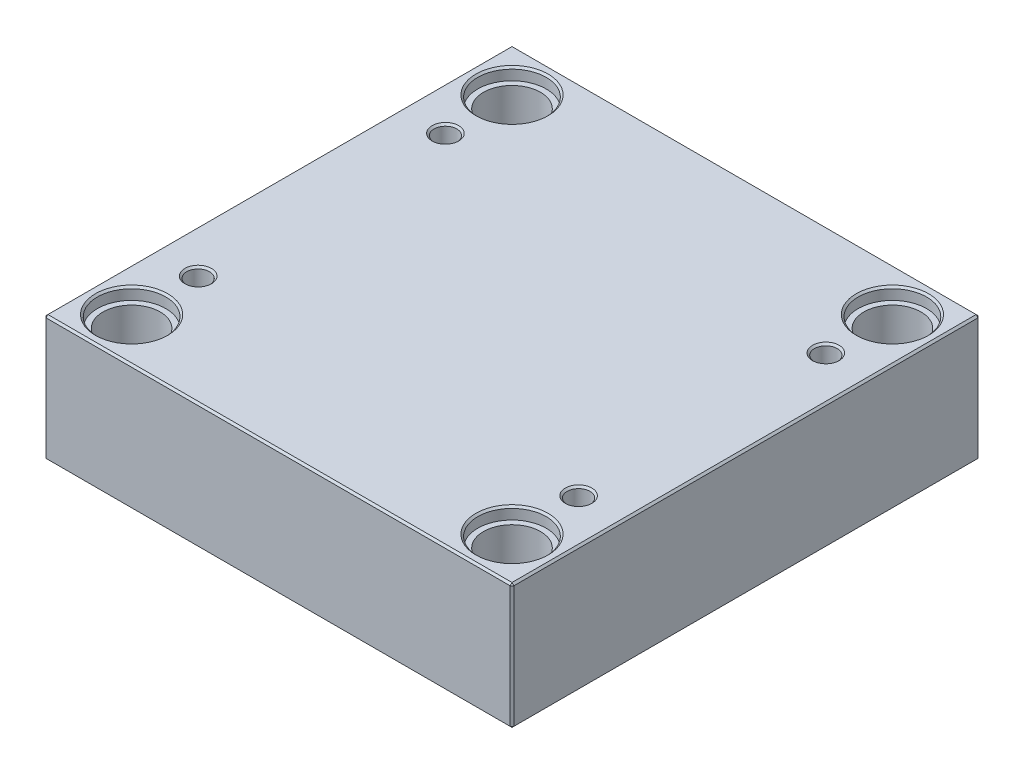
ISO-10303-21;
HEADER;
FILE_DESCRIPTION(('STEP AP214'),'2;1');
FILE_NAME('part.step','',(''),(''),'','','');
FILE_SCHEMA(('AUTOMOTIVE_DESIGN { 1 0 10303 214 1 1 1 1 }'));
ENDSEC;
DATA;
#1=APPLICATION_CONTEXT('core data for automotive mechanical design processes');
#2=APPLICATION_PROTOCOL_DEFINITION('international standard','automotive_design',2000,#1);
#3=PRODUCT_CONTEXT('',#1,'mechanical');
#4=PRODUCT('Part','Part','',(#3));
#5=PRODUCT_RELATED_PRODUCT_CATEGORY('part','',(#4));
#6=PRODUCT_DEFINITION_FORMATION('','',#4);
#7=PRODUCT_DEFINITION_CONTEXT('part definition',#1,'design');
#8=PRODUCT_DEFINITION('design','',#6,#7);
#9=PRODUCT_DEFINITION_SHAPE('','',#8);
#10=(LENGTH_UNIT() NAMED_UNIT(*) SI_UNIT(.MILLI.,.METRE.));
#11=(NAMED_UNIT(*) PLANE_ANGLE_UNIT() SI_UNIT($,.RADIAN.));
#12=(NAMED_UNIT(*) SI_UNIT($,.STERADIAN.) SOLID_ANGLE_UNIT());
#13=UNCERTAINTY_MEASURE_WITH_UNIT(LENGTH_MEASURE(1.E-05),#10,'distance_accuracy_value','');
#14=(GEOMETRIC_REPRESENTATION_CONTEXT(3) GLOBAL_UNCERTAINTY_ASSIGNED_CONTEXT((#13)) GLOBAL_UNIT_ASSIGNED_CONTEXT((#10,
#11,#12)) REPRESENTATION_CONTEXT('',''));
#15=CARTESIAN_POINT('',(0.,0.,0.));
#16=DIRECTION('',(0.,0.,1.));
#17=DIRECTION('',(1.,0.,0.));
#18=AXIS2_PLACEMENT_3D('',#15,#16,#17);
#19=CARTESIAN_POINT('',(-100.,0.,-100.));
#20=DIRECTION('',(0.,1.,0.));
#21=DIRECTION('',(0.,0.,1.));
#22=AXIS2_PLACEMENT_3D('',#19,#20,#21);
#23=CYLINDRICAL_SURFACE('',#22,15.);
#24=CARTESIAN_POINT('',(-100.,1.00000000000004,-100.));
#25=DIRECTION('',(0.,1.,0.));
#26=DIRECTION('',(0.,0.,1.));
#27=AXIS2_PLACEMENT_3D('',#24,#25,#26);
#28=CIRCLE('',#27,15.);
#29=CARTESIAN_POINT('',(-100.,1.00000000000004,-85.));
#30=VERTEX_POINT('',#29);
#31=EDGE_CURVE('E472',#30,#30,#28,.F.);
#32=ORIENTED_EDGE('',*,*,#31,.T.);
#33=EDGE_LOOP('',(#32));
#34=FACE_BOUND('',#33,.T.);
#35=CARTESIAN_POINT('',(-100.,59.7,-100.));
#36=DIRECTION('',(0.,1.,0.));
#37=DIRECTION('',(0.,0.,1.));
#38=AXIS2_PLACEMENT_3D('',#35,#36,#37);
#39=CIRCLE('',#38,15.);
#40=CARTESIAN_POINT('',(-100.,59.7,-85.));
#41=VERTEX_POINT('',#40);
#42=EDGE_CURVE('E221',#41,#41,#39,.F.);
#43=ORIENTED_EDGE('',*,*,#42,.F.);
#44=EDGE_LOOP('',(#43));
#45=FACE_BOUND('',#44,.T.);
#46=ADVANCED_FACE('F16',(#34,#45),#23,.F.);
#47=CARTESIAN_POINT('',(100.,0.,-100.));
#48=DIRECTION('',(0.,1.,0.));
#49=DIRECTION('',(0.,0.,1.));
#50=AXIS2_PLACEMENT_3D('',#47,#48,#49);
#51=CYLINDRICAL_SURFACE('',#50,15.);
#52=CARTESIAN_POINT('',(100.,1.00000000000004,-100.));
#53=DIRECTION('',(0.,1.,0.));
#54=DIRECTION('',(0.,0.,1.));
#55=AXIS2_PLACEMENT_3D('',#52,#53,#54);
#56=CIRCLE('',#55,15.);
#57=CARTESIAN_POINT('',(100.,1.00000000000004,-85.));
#58=VERTEX_POINT('',#57);
#59=EDGE_CURVE('E474',#58,#58,#56,.F.);
#60=ORIENTED_EDGE('',*,*,#59,.T.);
#61=EDGE_LOOP('',(#60));
#62=FACE_BOUND('',#61,.T.);
#63=CARTESIAN_POINT('',(100.,59.7,-100.));
#64=DIRECTION('',(0.,1.,0.));
#65=DIRECTION('',(0.,0.,1.));
#66=AXIS2_PLACEMENT_3D('',#63,#64,#65);
#67=CIRCLE('',#66,15.);
#68=CARTESIAN_POINT('',(100.,59.7,-85.));
#69=VERTEX_POINT('',#68);
#70=EDGE_CURVE('E218',#69,#69,#67,.F.);
#71=ORIENTED_EDGE('',*,*,#70,.F.);
#72=EDGE_LOOP('',(#71));
#73=FACE_BOUND('',#72,.T.);
#74=ADVANCED_FACE('F263',(#62,#73),#51,.F.);
#75=CARTESIAN_POINT('',(100.,0.,100.));
#76=DIRECTION('',(0.,1.,0.));
#77=DIRECTION('',(0.,0.,1.));
#78=AXIS2_PLACEMENT_3D('',#75,#76,#77);
#79=CYLINDRICAL_SURFACE('',#78,15.);
#80=CARTESIAN_POINT('',(100.,1.00000000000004,100.));
#81=DIRECTION('',(0.,1.,0.));
#82=DIRECTION('',(0.,0.,1.));
#83=AXIS2_PLACEMENT_3D('',#80,#81,#82);
#84=CIRCLE('',#83,15.);
#85=CARTESIAN_POINT('',(100.,1.00000000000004,115.));
#86=VERTEX_POINT('',#85);
#87=EDGE_CURVE('E477',#86,#86,#84,.F.);
#88=ORIENTED_EDGE('',*,*,#87,.T.);
#89=EDGE_LOOP('',(#88));
#90=FACE_BOUND('',#89,.T.);
#91=CARTESIAN_POINT('',(100.,59.7,100.));
#92=DIRECTION('',(0.,1.,0.));
#93=DIRECTION('',(0.,0.,1.));
#94=AXIS2_PLACEMENT_3D('',#91,#92,#93);
#95=CIRCLE('',#94,15.);
#96=CARTESIAN_POINT('',(100.,59.7,115.));
#97=VERTEX_POINT('',#96);
#98=EDGE_CURVE('E214',#97,#97,#95,.F.);
#99=ORIENTED_EDGE('',*,*,#98,.F.);
#100=EDGE_LOOP('',(#99));
#101=FACE_BOUND('',#100,.T.);
#102=ADVANCED_FACE('F270',(#90,#101),#79,.F.);
#103=CARTESIAN_POINT('',(-100.,0.,100.));
#104=DIRECTION('',(0.,1.,0.));
#105=DIRECTION('',(0.,0.,1.));
#106=AXIS2_PLACEMENT_3D('',#103,#104,#105);
#107=CYLINDRICAL_SURFACE('',#106,15.);
#108=CARTESIAN_POINT('',(-100.,0.999999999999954,100.));
#109=DIRECTION('',(0.,1.,0.));
#110=DIRECTION('',(0.,0.,1.));
#111=AXIS2_PLACEMENT_3D('',#108,#109,#110);
#112=CIRCLE('',#111,15.);
#113=CARTESIAN_POINT('',(-100.,0.999999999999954,115.));
#114=VERTEX_POINT('',#113);
#115=EDGE_CURVE('E480',#114,#114,#112,.F.);
#116=ORIENTED_EDGE('',*,*,#115,.T.);
#117=EDGE_LOOP('',(#116));
#118=FACE_BOUND('',#117,.T.);
#119=CARTESIAN_POINT('',(-100.,59.7,100.));
#120=DIRECTION('',(0.,1.,0.));
#121=DIRECTION('',(0.,0.,1.));
#122=AXIS2_PLACEMENT_3D('',#119,#120,#121);
#123=CIRCLE('',#122,15.);
#124=CARTESIAN_POINT('',(-100.,59.7,115.));
#125=VERTEX_POINT('',#124);
#126=EDGE_CURVE('E211',#125,#125,#123,.F.);
#127=ORIENTED_EDGE('',*,*,#126,.F.);
#128=EDGE_LOOP('',(#127));
#129=FACE_BOUND('',#128,.T.);
#130=ADVANCED_FACE('F277',(#118,#129),#107,.F.);
#131=CARTESIAN_POINT('',(-123.,66.,123.));
#132=DIRECTION('',(1.,0.,0.));
#133=DIRECTION('',(0.,0.,-1.));
#134=AXIS2_PLACEMENT_3D('',#131,#132,#133);
#135=PLANE('',#134);
#136=DIRECTION('',(0.,-1.,0.));
#137=VECTOR('',#136,1.);
#138=CARTESIAN_POINT('',(-123.,66.,-122.));
#139=LINE('',#138,#137);
#140=CARTESIAN_POINT('',(-123.,65.,-122.));
#141=VERTEX_POINT('',#140);
#142=CARTESIAN_POINT('',(-123.,1.,-122.));
#143=VERTEX_POINT('',#142);
#144=EDGE_CURVE('E487',#141,#143,#139,.T.);
#145=ORIENTED_EDGE('',*,*,#144,.T.);
#146=DIRECTION('',(0.,0.,1.));
#147=VECTOR('',#146,1.);
#148=CARTESIAN_POINT('',(-123.,1.,123.));
#149=LINE('',#148,#147);
#150=CARTESIAN_POINT('',(-123.,1.,122.));
#151=VERTEX_POINT('',#150);
#152=EDGE_CURVE('E490',#143,#151,#149,.T.);
#153=ORIENTED_EDGE('',*,*,#152,.T.);
#154=DIRECTION('',(0.,1.,0.));
#155=VECTOR('',#154,1.);
#156=CARTESIAN_POINT('',(-123.,66.,122.));
#157=LINE('',#156,#155);
#158=CARTESIAN_POINT('',(-123.,65.,122.));
#159=VERTEX_POINT('',#158);
#160=EDGE_CURVE('E485',#151,#159,#157,.T.);
#161=ORIENTED_EDGE('',*,*,#160,.T.);
#162=DIRECTION('',(0.,0.,-1.));
#163=VECTOR('',#162,1.);
#164=CARTESIAN_POINT('',(-123.,65.,-123.));
#165=LINE('',#164,#163);
#166=EDGE_CURVE('E483',#159,#141,#165,.T.);
#167=ORIENTED_EDGE('',*,*,#166,.T.);
#168=EDGE_LOOP('',(#145,#153,#161,#167));
#169=FACE_BOUND('',#168,.T.);
#170=ADVANCED_FACE('F298',(#169),#135,.F.);
#171=CARTESIAN_POINT('',(123.,66.,123.));
#172=DIRECTION('',(0.,0.,-1.));
#173=DIRECTION('',(-1.,0.,0.));
#174=AXIS2_PLACEMENT_3D('',#171,#172,#173);
#175=PLANE('',#174);
#176=DIRECTION('',(-1.,0.,0.));
#177=VECTOR('',#176,1.);
#178=CARTESIAN_POINT('',(-123.,65.,123.));
#179=LINE('',#178,#177);
#180=CARTESIAN_POINT('',(122.,65.,123.));
#181=VERTEX_POINT('',#180);
#182=CARTESIAN_POINT('',(-122.,65.,123.));
#183=VERTEX_POINT('',#182);
#184=EDGE_CURVE('E509',#181,#183,#179,.T.);
#185=ORIENTED_EDGE('',*,*,#184,.T.);
#186=DIRECTION('',(0.,-1.,0.));
#187=VECTOR('',#186,1.);
#188=CARTESIAN_POINT('',(-122.,66.,123.));
#189=LINE('',#188,#187);
#190=CARTESIAN_POINT('',(-122.,1.,123.));
#191=VERTEX_POINT('',#190);
#192=EDGE_CURVE('E515',#183,#191,#189,.T.);
#193=ORIENTED_EDGE('',*,*,#192,.T.);
#194=DIRECTION('',(1.,0.,0.));
#195=VECTOR('',#194,1.);
#196=CARTESIAN_POINT('',(123.,1.,123.));
#197=LINE('',#196,#195);
#198=CARTESIAN_POINT('',(122.,1.,123.));
#199=VERTEX_POINT('',#198);
#200=EDGE_CURVE('E513',#191,#199,#197,.T.);
#201=ORIENTED_EDGE('',*,*,#200,.T.);
#202=DIRECTION('',(0.,1.,0.));
#203=VECTOR('',#202,1.);
#204=CARTESIAN_POINT('',(122.,66.,123.));
#205=LINE('',#204,#203);
#206=EDGE_CURVE('E511',#199,#181,#205,.T.);
#207=ORIENTED_EDGE('',*,*,#206,.T.);
#208=EDGE_LOOP('',(#185,#193,#201,#207));
#209=FACE_BOUND('',#208,.T.);
#210=ADVANCED_FACE('F294',(#209),#175,.F.);
#211=CARTESIAN_POINT('',(123.,66.,123.));
#212=DIRECTION('',(-1.,0.,0.));
#213=DIRECTION('',(0.,0.,1.));
#214=AXIS2_PLACEMENT_3D('',#211,#212,#213);
#215=PLANE('',#214);
#216=DIRECTION('',(0.,0.,-1.));
#217=VECTOR('',#216,1.);
#218=CARTESIAN_POINT('',(123.,1.,123.));
#219=LINE('',#218,#217);
#220=CARTESIAN_POINT('',(123.,1.,122.));
#221=VERTEX_POINT('',#220);
#222=CARTESIAN_POINT('',(123.,1.,-122.));
#223=VERTEX_POINT('',#222);
#224=EDGE_CURVE('E504',#221,#223,#219,.T.);
#225=ORIENTED_EDGE('',*,*,#224,.T.);
#226=DIRECTION('',(0.,1.,0.));
#227=VECTOR('',#226,1.);
#228=CARTESIAN_POINT('',(123.,66.,-122.));
#229=LINE('',#228,#227);
#230=CARTESIAN_POINT('',(123.,65.,-122.));
#231=VERTEX_POINT('',#230);
#232=EDGE_CURVE('E506',#223,#231,#229,.T.);
#233=ORIENTED_EDGE('',*,*,#232,.T.);
#234=DIRECTION('',(0.,0.,1.));
#235=VECTOR('',#234,1.);
#236=CARTESIAN_POINT('',(123.,65.,123.));
#237=LINE('',#236,#235);
#238=CARTESIAN_POINT('',(123.,65.,122.));
#239=VERTEX_POINT('',#238);
#240=EDGE_CURVE('E500',#231,#239,#237,.T.);
#241=ORIENTED_EDGE('',*,*,#240,.T.);
#242=DIRECTION('',(0.,-1.,0.));
#243=VECTOR('',#242,1.);
#244=CARTESIAN_POINT('',(123.,66.,122.));
#245=LINE('',#244,#243);
#246=EDGE_CURVE('E502',#239,#221,#245,.T.);
#247=ORIENTED_EDGE('',*,*,#246,.T.);
#248=EDGE_LOOP('',(#225,#233,#241,#247));
#249=FACE_BOUND('',#248,.T.);
#250=ADVANCED_FACE('F290',(#249),#215,.F.);
#251=CARTESIAN_POINT('',(123.,66.,-123.));
#252=DIRECTION('',(0.,0.,1.));
#253=DIRECTION('',(1.,0.,0.));
#254=AXIS2_PLACEMENT_3D('',#251,#252,#253);
#255=PLANE('',#254);
#256=DIRECTION('',(0.,-1.,0.));
#257=VECTOR('',#256,1.);
#258=CARTESIAN_POINT('',(122.,66.,-123.));
#259=LINE('',#258,#257);
#260=CARTESIAN_POINT('',(122.,65.,-123.));
#261=VERTEX_POINT('',#260);
#262=CARTESIAN_POINT('',(122.,1.,-123.));
#263=VERTEX_POINT('',#262);
#264=EDGE_CURVE('E494',#261,#263,#259,.T.);
#265=ORIENTED_EDGE('',*,*,#264,.T.);
#266=DIRECTION('',(-1.,0.,0.));
#267=VECTOR('',#266,1.);
#268=CARTESIAN_POINT('',(123.,1.,-123.));
#269=LINE('',#268,#267);
#270=CARTESIAN_POINT('',(-122.,1.,-123.));
#271=VERTEX_POINT('',#270);
#272=EDGE_CURVE('E138',#263,#271,#269,.T.);
#273=ORIENTED_EDGE('',*,*,#272,.T.);
#274=DIRECTION('',(0.,1.,0.));
#275=VECTOR('',#274,1.);
#276=CARTESIAN_POINT('',(-122.,66.,-123.));
#277=LINE('',#276,#275);
#278=CARTESIAN_POINT('',(-122.,65.,-123.));
#279=VERTEX_POINT('',#278);
#280=EDGE_CURVE('E496',#271,#279,#277,.T.);
#281=ORIENTED_EDGE('',*,*,#280,.T.);
#282=DIRECTION('',(1.,0.,0.));
#283=VECTOR('',#282,1.);
#284=CARTESIAN_POINT('',(123.,65.,-123.));
#285=LINE('',#284,#283);
#286=EDGE_CURVE('E492',#279,#261,#285,.T.);
#287=ORIENTED_EDGE('',*,*,#286,.T.);
#288=EDGE_LOOP('',(#265,#273,#281,#287));
#289=FACE_BOUND('',#288,.T.);
#290=ADVANCED_FACE('F282',(#289),#255,.F.);
#291=CARTESIAN_POINT('',(0.,66.,0.));
#292=DIRECTION('',(0.,1.,0.));
#293=DIRECTION('',(0.,0.,1.));
#294=AXIS2_PLACEMENT_3D('',#291,#292,#293);
#295=PLANE('',#294);
#296=CARTESIAN_POINT('',(100.,66.,100.));
#297=DIRECTION('',(0.,1.,0.));
#298=DIRECTION('',(0.,0.,1.));
#299=AXIS2_PLACEMENT_3D('',#296,#297,#298);
#300=CIRCLE('',#299,19.);
#301=CARTESIAN_POINT('',(100.,66.,119.));
#302=VERTEX_POINT('',#301);
#303=EDGE_CURVE('E236',#302,#302,#300,.F.);
#304=ORIENTED_EDGE('',*,*,#303,.T.);
#305=EDGE_LOOP('',(#304));
#306=FACE_BOUND('',#305,.T.);
#307=CARTESIAN_POINT('',(-100.,66.,100.));
#308=DIRECTION('',(0.,1.,0.));
#309=DIRECTION('',(0.,0.,1.));
#310=AXIS2_PLACEMENT_3D('',#307,#308,#309);
#311=CIRCLE('',#310,19.);
#312=CARTESIAN_POINT('',(-100.,66.,119.));
#313=VERTEX_POINT('',#312);
#314=EDGE_CURVE('E233',#313,#313,#311,.F.);
#315=ORIENTED_EDGE('',*,*,#314,.T.);
#316=EDGE_LOOP('',(#315));
#317=FACE_BOUND('',#316,.T.);
#318=CARTESIAN_POINT('',(100.,66.,-100.));
#319=DIRECTION('',(0.,1.,0.));
#320=DIRECTION('',(0.,0.,1.));
#321=AXIS2_PLACEMENT_3D('',#318,#319,#320);
#322=CIRCLE('',#321,19.);
#323=CARTESIAN_POINT('',(100.,66.,-81.));
#324=VERTEX_POINT('',#323);
#325=EDGE_CURVE('E230',#324,#324,#322,.F.);
#326=ORIENTED_EDGE('',*,*,#325,.T.);
#327=EDGE_LOOP('',(#326));
#328=FACE_BOUND('',#327,.T.);
#329=CARTESIAN_POINT('',(-100.,66.,-100.));
#330=DIRECTION('',(0.,1.,0.));
#331=DIRECTION('',(0.,0.,1.));
#332=AXIS2_PLACEMENT_3D('',#329,#330,#331);
#333=CIRCLE('',#332,19.);
#334=CARTESIAN_POINT('',(-100.,66.,-81.));
#335=VERTEX_POINT('',#334);
#336=EDGE_CURVE('E227',#335,#335,#333,.F.);
#337=ORIENTED_EDGE('',*,*,#336,.T.);
#338=EDGE_LOOP('',(#337));
#339=FACE_BOUND('',#338,.T.);
#340=CARTESIAN_POINT('',(-100.,66.,65.));
#341=DIRECTION('',(0.,1.,0.));
#342=DIRECTION('',(0.,0.,1.));
#343=AXIS2_PLACEMENT_3D('',#340,#341,#342);
#344=CIRCLE('',#343,7.);
#345=CARTESIAN_POINT('',(-100.,66.,72.));
#346=VERTEX_POINT('',#345);
#347=EDGE_CURVE('E198',#346,#346,#344,.F.);
#348=ORIENTED_EDGE('',*,*,#347,.T.);
#349=EDGE_LOOP('',(#348));
#350=FACE_BOUND('',#349,.T.);
#351=CARTESIAN_POINT('',(100.,66.,65.));
#352=DIRECTION('',(0.,1.,0.));
#353=DIRECTION('',(0.,0.,1.));
#354=AXIS2_PLACEMENT_3D('',#351,#352,#353);
#355=CIRCLE('',#354,7.);
#356=CARTESIAN_POINT('',(100.,66.,72.));
#357=VERTEX_POINT('',#356);
#358=EDGE_CURVE('E195',#357,#357,#355,.F.);
#359=ORIENTED_EDGE('',*,*,#358,.T.);
#360=EDGE_LOOP('',(#359));
#361=FACE_BOUND('',#360,.T.);
#362=CARTESIAN_POINT('',(100.,66.,-65.));
#363=DIRECTION('',(0.,1.,0.));
#364=DIRECTION('',(0.,0.,1.));
#365=AXIS2_PLACEMENT_3D('',#362,#363,#364);
#366=CIRCLE('',#365,7.);
#367=CARTESIAN_POINT('',(100.,66.,-58.));
#368=VERTEX_POINT('',#367);
#369=EDGE_CURVE('E192',#368,#368,#366,.F.);
#370=ORIENTED_EDGE('',*,*,#369,.T.);
#371=EDGE_LOOP('',(#370));
#372=FACE_BOUND('',#371,.T.);
#373=CARTESIAN_POINT('',(-100.,66.,-65.));
#374=DIRECTION('',(0.,1.,0.));
#375=DIRECTION('',(0.,0.,1.));
#376=AXIS2_PLACEMENT_3D('',#373,#374,#375);
#377=CIRCLE('',#376,7.);
#378=CARTESIAN_POINT('',(-100.,66.,-58.));
#379=VERTEX_POINT('',#378);
#380=EDGE_CURVE('E188',#379,#379,#377,.F.);
#381=ORIENTED_EDGE('',*,*,#380,.T.);
#382=EDGE_LOOP('',(#381));
#383=FACE_BOUND('',#382,.T.);
#384=DIRECTION('',(0.,0.,-1.));
#385=VECTOR('',#384,1.);
#386=CARTESIAN_POINT('',(122.,66.,-123.));
#387=LINE('',#386,#385);
#388=CARTESIAN_POINT('',(122.,66.,122.));
#389=VERTEX_POINT('',#388);
#390=CARTESIAN_POINT('',(122.,66.,-122.));
#391=VERTEX_POINT('',#390);
#392=EDGE_CURVE('E31',#389,#391,#387,.T.);
#393=ORIENTED_EDGE('',*,*,#392,.T.);
#394=DIRECTION('',(-1.,0.,0.));
#395=VECTOR('',#394,1.);
#396=CARTESIAN_POINT('',(-123.,66.,-122.));
#397=LINE('',#396,#395);
#398=CARTESIAN_POINT('',(-122.,66.,-122.));
#399=VERTEX_POINT('',#398);
#400=EDGE_CURVE('E189',#391,#399,#397,.T.);
#401=ORIENTED_EDGE('',*,*,#400,.T.);
#402=DIRECTION('',(0.,0.,1.));
#403=VECTOR('',#402,1.);
#404=CARTESIAN_POINT('',(-122.,66.,123.));
#405=LINE('',#404,#403);
#406=CARTESIAN_POINT('',(-122.,66.,122.));
#407=VERTEX_POINT('',#406);
#408=EDGE_CURVE('E518',#399,#407,#405,.T.);
#409=ORIENTED_EDGE('',*,*,#408,.T.);
#410=DIRECTION('',(1.,0.,0.));
#411=VECTOR('',#410,1.);
#412=CARTESIAN_POINT('',(123.,66.,122.));
#413=LINE('',#412,#411);
#414=EDGE_CURVE('E36',#407,#389,#413,.T.);
#415=ORIENTED_EDGE('',*,*,#414,.T.);
#416=EDGE_LOOP('',(#393,#401,#409,#415));
#417=FACE_BOUND('',#416,.T.);
#418=ADVANCED_FACE('F279',(#306,#317,#328,#339,#350,#361,#372,#383,#417),#295,.T.);
#419=CARTESIAN_POINT('',(0.,0.,0.));
#420=DIRECTION('',(0.,1.,0.));
#421=DIRECTION('',(0.,0.,1.));
#422=AXIS2_PLACEMENT_3D('',#419,#420,#421);
#423=PLANE('',#422);
#424=CARTESIAN_POINT('',(-100.,0.,-100.));
#425=DIRECTION('',(0.,1.,0.));
#426=DIRECTION('',(0.,0.,1.));
#427=AXIS2_PLACEMENT_3D('',#424,#425,#426);
#428=CIRCLE('',#427,16.);
#429=CARTESIAN_POINT('',(-100.,0.,-84.));
#430=VERTEX_POINT('',#429);
#431=EDGE_CURVE('E469',#430,#430,#428,.T.);
#432=ORIENTED_EDGE('',*,*,#431,.T.);
#433=EDGE_LOOP('',(#432));
#434=FACE_BOUND('',#433,.T.);
#435=CARTESIAN_POINT('',(100.,0.,-100.));
#436=DIRECTION('',(0.,1.,0.));
#437=DIRECTION('',(0.,0.,1.));
#438=AXIS2_PLACEMENT_3D('',#435,#436,#437);
#439=CIRCLE('',#438,16.);
#440=CARTESIAN_POINT('',(100.,0.,-84.));
#441=VERTEX_POINT('',#440);
#442=EDGE_CURVE('E466',#441,#441,#439,.T.);
#443=ORIENTED_EDGE('',*,*,#442,.T.);
#444=EDGE_LOOP('',(#443));
#445=FACE_BOUND('',#444,.T.);
#446=CARTESIAN_POINT('',(100.,0.,100.));
#447=DIRECTION('',(0.,1.,0.));
#448=DIRECTION('',(0.,0.,1.));
#449=AXIS2_PLACEMENT_3D('',#446,#447,#448);
#450=CIRCLE('',#449,16.);
#451=CARTESIAN_POINT('',(100.,0.,116.));
#452=VERTEX_POINT('',#451);
#453=EDGE_CURVE('E463',#452,#452,#450,.T.);
#454=ORIENTED_EDGE('',*,*,#453,.T.);
#455=EDGE_LOOP('',(#454));
#456=FACE_BOUND('',#455,.T.);
#457=CARTESIAN_POINT('',(-100.,0.,100.));
#458=DIRECTION('',(0.,1.,0.));
#459=DIRECTION('',(0.,0.,1.));
#460=AXIS2_PLACEMENT_3D('',#457,#458,#459);
#461=CIRCLE('',#460,16.);
#462=CARTESIAN_POINT('',(-100.,0.,116.));
#463=VERTEX_POINT('',#462);
#464=EDGE_CURVE('E460',#463,#463,#461,.T.);
#465=ORIENTED_EDGE('',*,*,#464,.T.);
#466=EDGE_LOOP('',(#465));
#467=FACE_BOUND('',#466,.T.);
#468=DIRECTION('',(0.,0.,1.));
#469=VECTOR('',#468,1.);
#470=CARTESIAN_POINT('',(122.,0.,0.));
#471=LINE('',#470,#469);
#472=CARTESIAN_POINT('',(122.,0.,-122.));
#473=VERTEX_POINT('',#472);
#474=CARTESIAN_POINT('',(122.,0.,122.));
#475=VERTEX_POINT('',#474);
#476=EDGE_CURVE('E108',#473,#475,#471,.T.);
#477=ORIENTED_EDGE('',*,*,#476,.T.);
#478=DIRECTION('',(-1.,0.,0.));
#479=VECTOR('',#478,1.);
#480=CARTESIAN_POINT('',(0.,0.,122.));
#481=LINE('',#480,#479);
#482=CARTESIAN_POINT('',(-122.,0.,122.));
#483=VERTEX_POINT('',#482);
#484=EDGE_CURVE('E458',#475,#483,#481,.T.);
#485=ORIENTED_EDGE('',*,*,#484,.T.);
#486=DIRECTION('',(0.,0.,-1.));
#487=VECTOR('',#486,1.);
#488=CARTESIAN_POINT('',(-122.,0.,0.));
#489=LINE('',#488,#487);
#490=CARTESIAN_POINT('',(-122.,0.,-122.));
#491=VERTEX_POINT('',#490);
#492=EDGE_CURVE('E110',#483,#491,#489,.T.);
#493=ORIENTED_EDGE('',*,*,#492,.T.);
#494=DIRECTION('',(1.,0.,0.));
#495=VECTOR('',#494,1.);
#496=CARTESIAN_POINT('',(0.,0.,-122.));
#497=LINE('',#496,#495);
#498=EDGE_CURVE('E104',#491,#473,#497,.T.);
#499=ORIENTED_EDGE('',*,*,#498,.T.);
#500=EDGE_LOOP('',(#477,#485,#493,#499));
#501=FACE_BOUND('',#500,.T.);
#502=ADVANCED_FACE('F106',(#434,#445,#456,#467,#501),#423,.F.);
#503=CARTESIAN_POINT('',(-100.,0.,-100.));
#504=DIRECTION('',(0.,-1.,0.));
#505=DIRECTION('',(0.,0.,-1.));
#506=AXIS2_PLACEMENT_3D('',#503,#504,#505);
#507=CONICAL_SURFACE('',#506,16.,0.785398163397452);
#508=ORIENTED_EDGE('',*,*,#31,.F.);
#509=EDGE_LOOP('',(#508));
#510=FACE_BOUND('',#509,.T.);
#511=ORIENTED_EDGE('',*,*,#431,.F.);
#512=EDGE_LOOP('',(#511));
#513=FACE_BOUND('',#512,.T.);
#514=ADVANCED_FACE('F286',(#510,#513),#507,.F.);
#515=CARTESIAN_POINT('',(100.,0.,-100.));
#516=DIRECTION('',(0.,-1.,0.));
#517=DIRECTION('',(0.,0.,-1.));
#518=AXIS2_PLACEMENT_3D('',#515,#516,#517);
#519=CONICAL_SURFACE('',#518,16.,0.785398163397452);
#520=ORIENTED_EDGE('',*,*,#59,.F.);
#521=EDGE_LOOP('',(#520));
#522=FACE_BOUND('',#521,.T.);
#523=ORIENTED_EDGE('',*,*,#442,.F.);
#524=EDGE_LOOP('',(#523));
#525=FACE_BOUND('',#524,.T.);
#526=ADVANCED_FACE('F305',(#522,#525),#519,.F.);
#527=CARTESIAN_POINT('',(100.,0.,100.));
#528=DIRECTION('',(0.,-1.,0.));
#529=DIRECTION('',(0.,0.,-1.));
#530=AXIS2_PLACEMENT_3D('',#527,#528,#529);
#531=CONICAL_SURFACE('',#530,16.,0.785398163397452);
#532=ORIENTED_EDGE('',*,*,#87,.F.);
#533=EDGE_LOOP('',(#532));
#534=FACE_BOUND('',#533,.T.);
#535=ORIENTED_EDGE('',*,*,#453,.F.);
#536=EDGE_LOOP('',(#535));
#537=FACE_BOUND('',#536,.T.);
#538=ADVANCED_FACE('F309',(#534,#537),#531,.F.);
#539=CARTESIAN_POINT('',(-100.,0.,100.));
#540=DIRECTION('',(0.,-1.,0.));
#541=DIRECTION('',(0.,0.,-1.));
#542=AXIS2_PLACEMENT_3D('',#539,#540,#541);
#543=CONICAL_SURFACE('',#542,16.,0.785398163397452);
#544=ORIENTED_EDGE('',*,*,#115,.F.);
#545=EDGE_LOOP('',(#544));
#546=FACE_BOUND('',#545,.T.);
#547=ORIENTED_EDGE('',*,*,#464,.F.);
#548=EDGE_LOOP('',(#547));
#549=FACE_BOUND('',#548,.T.);
#550=ADVANCED_FACE('F313',(#546,#549),#543,.F.);
#551=CARTESIAN_POINT('',(123.,66.,122.));
#552=DIRECTION('',(-0.707106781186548,0.,-0.707106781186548));
#553=DIRECTION('',(0.,-1.,0.));
#554=AXIS2_PLACEMENT_3D('',#551,#552,#553);
#555=PLANE('',#554);
#556=DIRECTION('',(-0.707106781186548,0.,0.707106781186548));
#557=VECTOR('',#556,1.);
#558=CARTESIAN_POINT('',(122.,65.,123.));
#559=LINE('',#558,#557);
#560=EDGE_CURVE('E126',#181,#239,#559,.F.);
#561=ORIENTED_EDGE('',*,*,#560,.F.);
#562=ORIENTED_EDGE('',*,*,#206,.F.);
#563=DIRECTION('',(0.707106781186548,0.,-0.707106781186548));
#564=VECTOR('',#563,1.);
#565=CARTESIAN_POINT('',(122.,1.,123.));
#566=LINE('',#565,#564);
#567=EDGE_CURVE('E180',#221,#199,#566,.F.);
#568=ORIENTED_EDGE('',*,*,#567,.F.);
#569=ORIENTED_EDGE('',*,*,#246,.F.);
#570=EDGE_LOOP('',(#561,#562,#568,#569));
#571=FACE_BOUND('',#570,.T.);
#572=ADVANCED_FACE('F317',(#571),#555,.F.);
#573=CARTESIAN_POINT('',(122.,65.,123.));
#574=DIRECTION('',(0.577350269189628,0.57735026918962,0.577350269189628));
#575=DIRECTION('',(0.707106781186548,0.,-0.707106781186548));
#576=AXIS2_PLACEMENT_3D('',#573,#574,#575);
#577=PLANE('',#576);
#578=DIRECTION('',(0.,-0.70710678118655,0.707106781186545));
#579=VECTOR('',#578,1.);
#580=CARTESIAN_POINT('',(122.,65.,123.));
#581=LINE('',#580,#579);
#582=EDGE_CURVE('E175',#181,#389,#581,.F.);
#583=ORIENTED_EDGE('',*,*,#582,.F.);
#584=ORIENTED_EDGE('',*,*,#560,.T.);
#585=DIRECTION('',(-0.707106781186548,0.707106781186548,0.));
#586=VECTOR('',#585,1.);
#587=CARTESIAN_POINT('',(122.5,65.5,122.));
#588=LINE('',#587,#586);
#589=EDGE_CURVE('E177',#389,#239,#588,.F.);
#590=ORIENTED_EDGE('',*,*,#589,.F.);
#591=EDGE_LOOP('',(#583,#584,#590));
#592=FACE_BOUND('',#591,.T.);
#593=ADVANCED_FACE('F385',(#592),#577,.T.);
#594=CARTESIAN_POINT('',(122.,1.,123.));
#595=DIRECTION('',(0.577350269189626,-0.577350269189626,0.577350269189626));
#596=DIRECTION('',(0.707106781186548,0.,-0.707106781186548));
#597=AXIS2_PLACEMENT_3D('',#594,#595,#596);
#598=PLANE('',#597);
#599=DIRECTION('',(-0.707106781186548,-0.707106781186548,0.));
#600=VECTOR('',#599,1.);
#601=CARTESIAN_POINT('',(122.5,0.5,122.));
#602=LINE('',#601,#600);
#603=EDGE_CURVE('E124',#221,#475,#602,.T.);
#604=ORIENTED_EDGE('',*,*,#603,.F.);
#605=ORIENTED_EDGE('',*,*,#567,.T.);
#606=DIRECTION('',(0.,0.70710678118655,0.707106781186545));
#607=VECTOR('',#606,1.);
#608=CARTESIAN_POINT('',(122.,1.,123.));
#609=LINE('',#608,#607);
#610=EDGE_CURVE('E172',#475,#199,#609,.T.);
#611=ORIENTED_EDGE('',*,*,#610,.F.);
#612=EDGE_LOOP('',(#604,#605,#611));
#613=FACE_BOUND('',#612,.T.);
#614=ADVANCED_FACE('F381',(#613),#598,.T.);
#615=CARTESIAN_POINT('',(122.,66.,0.));
#616=DIRECTION('',(0.707106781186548,0.707106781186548,0.));
#617=DIRECTION('',(0.,0.,1.));
#618=AXIS2_PLACEMENT_3D('',#615,#616,#617);
#619=PLANE('',#618);
#620=ORIENTED_EDGE('',*,*,#589,.T.);
#621=ORIENTED_EDGE('',*,*,#240,.F.);
#622=DIRECTION('',(0.707106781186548,-0.707106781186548,0.));
#623=VECTOR('',#622,1.);
#624=CARTESIAN_POINT('',(123.,65.,-122.));
#625=LINE('',#624,#623);
#626=EDGE_CURVE('E166',#391,#231,#625,.T.);
#627=ORIENTED_EDGE('',*,*,#626,.F.);
#628=ORIENTED_EDGE('',*,*,#392,.F.);
#629=EDGE_LOOP('',(#620,#621,#627,#628));
#630=FACE_BOUND('',#629,.T.);
#631=ADVANCED_FACE('F377',(#630),#619,.T.);
#632=CARTESIAN_POINT('',(0.,66.,122.));
#633=DIRECTION('',(0.,0.707106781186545,0.70710678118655));
#634=DIRECTION('',(-1.,0.,0.));
#635=AXIS2_PLACEMENT_3D('',#632,#633,#634);
#636=PLANE('',#635);
#637=ORIENTED_EDGE('',*,*,#582,.T.);
#638=ORIENTED_EDGE('',*,*,#414,.F.);
#639=DIRECTION('',(0.,0.70710678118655,-0.707106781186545));
#640=VECTOR('',#639,1.);
#641=CARTESIAN_POINT('',(-122.,65.5,122.5));
#642=LINE('',#641,#640);
#643=EDGE_CURVE('E163',#183,#407,#642,.T.);
#644=ORIENTED_EDGE('',*,*,#643,.F.);
#645=ORIENTED_EDGE('',*,*,#184,.F.);
#646=EDGE_LOOP('',(#637,#638,#644,#645));
#647=FACE_BOUND('',#646,.T.);
#648=ADVANCED_FACE('F373',(#647),#636,.T.);
#649=CARTESIAN_POINT('',(-122.,66.,123.));
#650=DIRECTION('',(0.707106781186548,0.,-0.707106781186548));
#651=DIRECTION('',(0.,-1.,0.));
#652=AXIS2_PLACEMENT_3D('',#649,#650,#651);
#653=PLANE('',#652);
#654=DIRECTION('',(0.707106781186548,0.,0.707106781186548));
#655=VECTOR('',#654,1.);
#656=CARTESIAN_POINT('',(-122.,1.,123.));
#657=LINE('',#656,#655);
#658=EDGE_CURVE('E157',#191,#151,#657,.F.);
#659=ORIENTED_EDGE('',*,*,#658,.F.);
#660=ORIENTED_EDGE('',*,*,#192,.F.);
#661=DIRECTION('',(-0.707106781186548,0.,-0.707106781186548));
#662=VECTOR('',#661,1.);
#663=CARTESIAN_POINT('',(-123.,65.,122.));
#664=LINE('',#663,#662);
#665=EDGE_CURVE('E160',#159,#183,#664,.F.);
#666=ORIENTED_EDGE('',*,*,#665,.F.);
#667=ORIENTED_EDGE('',*,*,#160,.F.);
#668=EDGE_LOOP('',(#659,#660,#666,#667));
#669=FACE_BOUND('',#668,.T.);
#670=ADVANCED_FACE('F369',(#669),#653,.F.);
#671=CARTESIAN_POINT('',(123.,1.,123.));
#672=DIRECTION('',(0.,0.707106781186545,-0.70710678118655));
#673=DIRECTION('',(1.,0.,0.));
#674=AXIS2_PLACEMENT_3D('',#671,#672,#673);
#675=PLANE('',#674);
#676=ORIENTED_EDGE('',*,*,#610,.T.);
#677=ORIENTED_EDGE('',*,*,#200,.F.);
#678=DIRECTION('',(0.,-0.70710678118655,-0.707106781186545));
#679=VECTOR('',#678,1.);
#680=CARTESIAN_POINT('',(-122.,1.,123.));
#681=LINE('',#680,#679);
#682=EDGE_CURVE('E135',#483,#191,#681,.F.);
#683=ORIENTED_EDGE('',*,*,#682,.F.);
#684=ORIENTED_EDGE('',*,*,#484,.F.);
#685=EDGE_LOOP('',(#676,#677,#683,#684));
#686=FACE_BOUND('',#685,.T.);
#687=ADVANCED_FACE('F366',(#686),#675,.F.);
#688=CARTESIAN_POINT('',(123.,1.,123.));
#689=DIRECTION('',(-0.707106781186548,0.707106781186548,0.));
#690=DIRECTION('',(0.,0.,-1.));
#691=AXIS2_PLACEMENT_3D('',#688,#689,#690);
#692=PLANE('',#691);
#693=ORIENTED_EDGE('',*,*,#603,.T.);
#694=ORIENTED_EDGE('',*,*,#476,.F.);
#695=DIRECTION('',(0.707106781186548,0.707106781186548,0.));
#696=VECTOR('',#695,1.);
#697=CARTESIAN_POINT('',(122.5,0.499999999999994,-122.));
#698=LINE('',#697,#696);
#699=EDGE_CURVE('E121',#223,#473,#698,.F.);
#700=ORIENTED_EDGE('',*,*,#699,.F.);
#701=ORIENTED_EDGE('',*,*,#224,.F.);
#702=EDGE_LOOP('',(#693,#694,#700,#701));
#703=FACE_BOUND('',#702,.T.);
#704=ADVANCED_FACE('F119',(#703),#692,.F.);
#705=CARTESIAN_POINT('',(122.,66.,-123.));
#706=DIRECTION('',(-0.707106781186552,0.,0.707106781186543));
#707=DIRECTION('',(0.,-1.,0.));
#708=AXIS2_PLACEMENT_3D('',#705,#706,#707);
#709=PLANE('',#708);
#710=DIRECTION('',(0.707106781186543,0.,0.707106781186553));
#711=VECTOR('',#710,1.);
#712=CARTESIAN_POINT('',(123.,65.,-122.));
#713=LINE('',#712,#711);
#714=EDGE_CURVE('E168',#231,#261,#713,.F.);
#715=ORIENTED_EDGE('',*,*,#714,.F.);
#716=ORIENTED_EDGE('',*,*,#232,.F.);
#717=DIRECTION('',(-0.707106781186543,0.,-0.707106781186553));
#718=VECTOR('',#717,1.);
#719=CARTESIAN_POINT('',(122.,1.,-123.));
#720=LINE('',#719,#718);
#721=EDGE_CURVE('E134',#263,#223,#720,.F.);
#722=ORIENTED_EDGE('',*,*,#721,.F.);
#723=ORIENTED_EDGE('',*,*,#264,.F.);
#724=EDGE_LOOP('',(#715,#716,#722,#723));
#725=FACE_BOUND('',#724,.T.);
#726=ADVANCED_FACE('F359',(#725),#709,.F.);
#727=CARTESIAN_POINT('',(123.,65.,-122.));
#728=DIRECTION('',(0.577350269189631,0.577350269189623,-0.577350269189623));
#729=DIRECTION('',(-0.707106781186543,0.,-0.707106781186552));
#730=AXIS2_PLACEMENT_3D('',#727,#728,#729);
#731=PLANE('',#730);
#732=ORIENTED_EDGE('',*,*,#626,.T.);
#733=ORIENTED_EDGE('',*,*,#714,.T.);
#734=DIRECTION('',(0.,0.707106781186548,0.707106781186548));
#735=VECTOR('',#734,1.);
#736=CARTESIAN_POINT('',(122.,65.5,-122.5));
#737=LINE('',#736,#735);
#738=EDGE_CURVE('E152',#391,#261,#737,.F.);
#739=ORIENTED_EDGE('',*,*,#738,.F.);
#740=EDGE_LOOP('',(#732,#733,#739));
#741=FACE_BOUND('',#740,.T.);
#742=ADVANCED_FACE('F355',(#741),#731,.T.);
#743=CARTESIAN_POINT('',(-123.,65.,122.));
#744=DIRECTION('',(-0.577350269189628,0.57735026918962,0.577350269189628));
#745=DIRECTION('',(0.707106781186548,0.,0.707106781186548));
#746=AXIS2_PLACEMENT_3D('',#743,#744,#745);
#747=PLANE('',#746);
#748=ORIENTED_EDGE('',*,*,#665,.T.);
#749=ORIENTED_EDGE('',*,*,#643,.T.);
#750=DIRECTION('',(-0.707106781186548,-0.707106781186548,0.));
#751=VECTOR('',#750,1.);
#752=CARTESIAN_POINT('',(-123.,65.,122.));
#753=LINE('',#752,#751);
#754=EDGE_CURVE('E143',#159,#407,#753,.F.);
#755=ORIENTED_EDGE('',*,*,#754,.F.);
#756=EDGE_LOOP('',(#748,#749,#755));
#757=FACE_BOUND('',#756,.T.);
#758=ADVANCED_FACE('F351',(#757),#747,.T.);
#759=CARTESIAN_POINT('',(-122.,1.,123.));
#760=DIRECTION('',(-0.577350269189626,-0.577350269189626,0.577350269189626));
#761=DIRECTION('',(0.707106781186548,0.,0.707106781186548));
#762=AXIS2_PLACEMENT_3D('',#759,#760,#761);
#763=PLANE('',#762);
#764=ORIENTED_EDGE('',*,*,#682,.T.);
#765=ORIENTED_EDGE('',*,*,#658,.T.);
#766=DIRECTION('',(-0.707106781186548,0.707106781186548,0.));
#767=VECTOR('',#766,1.);
#768=CARTESIAN_POINT('',(-122.5,0.5,122.));
#769=LINE('',#768,#767);
#770=EDGE_CURVE('E139',#483,#151,#769,.T.);
#771=ORIENTED_EDGE('',*,*,#770,.F.);
#772=EDGE_LOOP('',(#764,#765,#771));
#773=FACE_BOUND('',#772,.T.);
#774=ADVANCED_FACE('F348',(#773),#763,.T.);
#775=CARTESIAN_POINT('',(122.,1.,-123.));
#776=DIRECTION('',(0.577350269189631,-0.577350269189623,-0.577350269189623));
#777=DIRECTION('',(-0.707106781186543,0.,-0.707106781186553));
#778=AXIS2_PLACEMENT_3D('',#775,#776,#777);
#779=PLANE('',#778);
#780=ORIENTED_EDGE('',*,*,#721,.T.);
#781=ORIENTED_EDGE('',*,*,#699,.T.);
#782=DIRECTION('',(0.,-0.707106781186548,0.707106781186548));
#783=VECTOR('',#782,1.);
#784=CARTESIAN_POINT('',(122.,1.,-123.));
#785=LINE('',#784,#783);
#786=EDGE_CURVE('E131',#263,#473,#785,.T.);
#787=ORIENTED_EDGE('',*,*,#786,.F.);
#788=EDGE_LOOP('',(#780,#781,#787));
#789=FACE_BOUND('',#788,.T.);
#790=ADVANCED_FACE('F130',(#789),#779,.T.);
#791=CARTESIAN_POINT('',(0.,66.,-122.));
#792=DIRECTION('',(0.,0.707106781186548,-0.707106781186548));
#793=DIRECTION('',(1.,0.,0.));
#794=AXIS2_PLACEMENT_3D('',#791,#792,#793);
#795=PLANE('',#794);
#796=ORIENTED_EDGE('',*,*,#738,.T.);
#797=ORIENTED_EDGE('',*,*,#286,.F.);
#798=DIRECTION('',(0.,-0.707106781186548,-0.707106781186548));
#799=VECTOR('',#798,1.);
#800=CARTESIAN_POINT('',(-122.,65.,-123.));
#801=LINE('',#800,#799);
#802=EDGE_CURVE('E140',#399,#279,#801,.T.);
#803=ORIENTED_EDGE('',*,*,#802,.F.);
#804=ORIENTED_EDGE('',*,*,#400,.F.);
#805=EDGE_LOOP('',(#796,#797,#803,#804));
#806=FACE_BOUND('',#805,.T.);
#807=ADVANCED_FACE('F341',(#806),#795,.T.);
#808=CARTESIAN_POINT('',(-122.,66.,0.));
#809=DIRECTION('',(-0.707106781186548,0.707106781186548,0.));
#810=DIRECTION('',(0.,0.,-1.));
#811=AXIS2_PLACEMENT_3D('',#808,#809,#810);
#812=PLANE('',#811);
#813=ORIENTED_EDGE('',*,*,#754,.T.);
#814=ORIENTED_EDGE('',*,*,#408,.F.);
#815=DIRECTION('',(0.707106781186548,0.707106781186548,0.));
#816=VECTOR('',#815,1.);
#817=CARTESIAN_POINT('',(-122.5,65.5,-122.));
#818=LINE('',#817,#816);
#819=EDGE_CURVE('E146',#141,#399,#818,.T.);
#820=ORIENTED_EDGE('',*,*,#819,.F.);
#821=ORIENTED_EDGE('',*,*,#166,.F.);
#822=EDGE_LOOP('',(#813,#814,#820,#821));
#823=FACE_BOUND('',#822,.T.);
#824=ADVANCED_FACE('F337',(#823),#812,.T.);
#825=CARTESIAN_POINT('',(-123.,1.,123.));
#826=DIRECTION('',(0.707106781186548,0.707106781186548,0.));
#827=DIRECTION('',(0.,0.,1.));
#828=AXIS2_PLACEMENT_3D('',#825,#826,#827);
#829=PLANE('',#828);
#830=ORIENTED_EDGE('',*,*,#770,.T.);
#831=ORIENTED_EDGE('',*,*,#152,.F.);
#832=DIRECTION('',(0.707106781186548,-0.707106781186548,0.));
#833=VECTOR('',#832,1.);
#834=CARTESIAN_POINT('',(-123.,1.,-122.));
#835=LINE('',#834,#833);
#836=EDGE_CURVE('E529',#491,#143,#835,.F.);
#837=ORIENTED_EDGE('',*,*,#836,.F.);
#838=ORIENTED_EDGE('',*,*,#492,.F.);
#839=EDGE_LOOP('',(#830,#831,#837,#838));
#840=FACE_BOUND('',#839,.T.);
#841=ADVANCED_FACE('F334',(#840),#829,.F.);
#842=CARTESIAN_POINT('',(123.,1.,-123.));
#843=DIRECTION('',(0.,0.707106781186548,0.707106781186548));
#844=DIRECTION('',(-1.,0.,0.));
#845=AXIS2_PLACEMENT_3D('',#842,#843,#844);
#846=PLANE('',#845);
#847=ORIENTED_EDGE('',*,*,#786,.T.);
#848=ORIENTED_EDGE('',*,*,#498,.F.);
#849=DIRECTION('',(0.,0.707106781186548,-0.707106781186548));
#850=VECTOR('',#849,1.);
#851=CARTESIAN_POINT('',(-122.,0.5,-122.5));
#852=LINE('',#851,#850);
#853=EDGE_CURVE('E526',#271,#491,#852,.F.);
#854=ORIENTED_EDGE('',*,*,#853,.F.);
#855=ORIENTED_EDGE('',*,*,#272,.F.);
#856=EDGE_LOOP('',(#847,#848,#854,#855));
#857=FACE_BOUND('',#856,.T.);
#858=ADVANCED_FACE('F137',(#857),#846,.F.);
#859=CARTESIAN_POINT('',(-122.,65.,-123.));
#860=DIRECTION('',(-0.577350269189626,0.577350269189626,-0.577350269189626));
#861=DIRECTION('',(-0.707106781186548,0.,0.707106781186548));
#862=AXIS2_PLACEMENT_3D('',#859,#860,#861);
#863=PLANE('',#862);
#864=ORIENTED_EDGE('',*,*,#819,.T.);
#865=ORIENTED_EDGE('',*,*,#802,.T.);
#866=DIRECTION('',(0.707106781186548,0.,-0.707106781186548));
#867=VECTOR('',#866,1.);
#868=CARTESIAN_POINT('',(-122.,65.,-123.));
#869=LINE('',#868,#867);
#870=EDGE_CURVE('E524',#141,#279,#869,.T.);
#871=ORIENTED_EDGE('',*,*,#870,.F.);
#872=EDGE_LOOP('',(#864,#865,#871));
#873=FACE_BOUND('',#872,.T.);
#874=ADVANCED_FACE('F327',(#873),#863,.T.);
#875=CARTESIAN_POINT('',(-123.,1.,-122.));
#876=DIRECTION('',(-0.577350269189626,-0.577350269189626,-0.577350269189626));
#877=DIRECTION('',(-0.707106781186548,0.,0.707106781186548));
#878=AXIS2_PLACEMENT_3D('',#875,#876,#877);
#879=PLANE('',#878);
#880=ORIENTED_EDGE('',*,*,#853,.T.);
#881=ORIENTED_EDGE('',*,*,#836,.T.);
#882=DIRECTION('',(-0.707106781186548,0.,0.707106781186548));
#883=VECTOR('',#882,1.);
#884=CARTESIAN_POINT('',(-123.,1.,-122.));
#885=LINE('',#884,#883);
#886=EDGE_CURVE('E455',#271,#143,#885,.T.);
#887=ORIENTED_EDGE('',*,*,#886,.F.);
#888=EDGE_LOOP('',(#880,#881,#887));
#889=FACE_BOUND('',#888,.T.);
#890=ADVANCED_FACE('F323',(#889),#879,.T.);
#891=CARTESIAN_POINT('',(-123.,66.,-122.));
#892=DIRECTION('',(0.707106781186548,0.,0.707106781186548));
#893=DIRECTION('',(0.,-1.,0.));
#894=AXIS2_PLACEMENT_3D('',#891,#892,#893);
#895=PLANE('',#894);
#896=ORIENTED_EDGE('',*,*,#870,.T.);
#897=ORIENTED_EDGE('',*,*,#280,.F.);
#898=ORIENTED_EDGE('',*,*,#886,.T.);
#899=ORIENTED_EDGE('',*,*,#144,.F.);
#900=EDGE_LOOP('',(#896,#897,#898,#899));
#901=FACE_BOUND('',#900,.T.);
#902=ADVANCED_FACE('F319',(#901),#895,.F.);
#903=CARTESIAN_POINT('',(-100.,42.,-65.));
#904=DIRECTION('',(0.,1.,0.));
#905=DIRECTION('',(0.,0.,1.));
#906=AXIS2_PLACEMENT_3D('',#903,#904,#905);
#907=CYLINDRICAL_SURFACE('',#906,6.);
#908=CARTESIAN_POINT('',(-100.,65.,-65.));
#909=DIRECTION('',(0.,1.,0.));
#910=DIRECTION('',(0.,0.,1.));
#911=AXIS2_PLACEMENT_3D('',#908,#909,#910);
#912=CIRCLE('',#911,6.);
#913=CARTESIAN_POINT('',(-100.,65.,-59.));
#914=VERTEX_POINT('',#913);
#915=EDGE_CURVE('E207',#914,#914,#912,.T.);
#916=ORIENTED_EDGE('',*,*,#915,.T.);
#917=EDGE_LOOP('',(#916));
#918=FACE_BOUND('',#917,.T.);
#919=CARTESIAN_POINT('',(-100.,42.,-65.));
#920=DIRECTION('',(0.,1.,0.));
#921=DIRECTION('',(0.,0.,1.));
#922=AXIS2_PLACEMENT_3D('',#919,#920,#921);
#923=CIRCLE('',#922,6.);
#924=CARTESIAN_POINT('',(-100.,42.,-59.));
#925=VERTEX_POINT('',#924);
#926=EDGE_CURVE('E448',#925,#925,#923,.T.);
#927=ORIENTED_EDGE('',*,*,#926,.F.);
#928=EDGE_LOOP('',(#927));
#929=FACE_BOUND('',#928,.T.);
#930=ADVANCED_FACE('F322',(#918,#929),#907,.F.);
#931=CARTESIAN_POINT('',(-100.,42.,-65.));
#932=DIRECTION('',(0.,1.,0.));
#933=DIRECTION('',(0.,0.,1.));
#934=AXIS2_PLACEMENT_3D('',#931,#932,#933);
#935=PLANE('',#934);
#936=ORIENTED_EDGE('',*,*,#926,.T.);
#937=EDGE_LOOP('',(#936));
#938=FACE_BOUND('',#937,.T.);
#939=ADVANCED_FACE('F596',(#938),#935,.T.);
#940=CARTESIAN_POINT('',(100.,42.,-65.));
#941=DIRECTION('',(0.,1.,0.));
#942=DIRECTION('',(0.,0.,1.));
#943=AXIS2_PLACEMENT_3D('',#940,#941,#942);
#944=CYLINDRICAL_SURFACE('',#943,6.);
#945=CARTESIAN_POINT('',(100.,65.,-65.));
#946=DIRECTION('',(0.,1.,0.));
#947=DIRECTION('',(0.,0.,1.));
#948=AXIS2_PLACEMENT_3D('',#945,#946,#947);
#949=CIRCLE('',#948,6.);
#950=CARTESIAN_POINT('',(100.,65.,-59.));
#951=VERTEX_POINT('',#950);
#952=EDGE_CURVE('E204',#951,#951,#949,.T.);
#953=ORIENTED_EDGE('',*,*,#952,.T.);
#954=EDGE_LOOP('',(#953));
#955=FACE_BOUND('',#954,.T.);
#956=CARTESIAN_POINT('',(100.,42.,-65.));
#957=DIRECTION('',(0.,1.,0.));
#958=DIRECTION('',(0.,0.,1.));
#959=AXIS2_PLACEMENT_3D('',#956,#957,#958);
#960=CIRCLE('',#959,6.);
#961=CARTESIAN_POINT('',(100.,42.,-59.));
#962=VERTEX_POINT('',#961);
#963=EDGE_CURVE('E445',#962,#962,#960,.T.);
#964=ORIENTED_EDGE('',*,*,#963,.F.);
#965=EDGE_LOOP('',(#964));
#966=FACE_BOUND('',#965,.T.);
#967=ADVANCED_FACE('F592',(#955,#966),#944,.F.);
#968=CARTESIAN_POINT('',(100.,42.,-65.));
#969=DIRECTION('',(0.,1.,0.));
#970=DIRECTION('',(0.,0.,1.));
#971=AXIS2_PLACEMENT_3D('',#968,#969,#970);
#972=PLANE('',#971);
#973=ORIENTED_EDGE('',*,*,#963,.T.);
#974=EDGE_LOOP('',(#973));
#975=FACE_BOUND('',#974,.T.);
#976=ADVANCED_FACE('F588',(#975),#972,.T.);
#977=CARTESIAN_POINT('',(100.,42.,65.));
#978=DIRECTION('',(0.,1.,0.));
#979=DIRECTION('',(0.,0.,1.));
#980=AXIS2_PLACEMENT_3D('',#977,#978,#979);
#981=CYLINDRICAL_SURFACE('',#980,6.);
#982=CARTESIAN_POINT('',(100.,65.,65.));
#983=DIRECTION('',(0.,1.,0.));
#984=DIRECTION('',(0.,0.,1.));
#985=AXIS2_PLACEMENT_3D('',#982,#983,#984);
#986=CIRCLE('',#985,6.);
#987=CARTESIAN_POINT('',(100.,65.,71.));
#988=VERTEX_POINT('',#987);
#989=EDGE_CURVE('E201',#988,#988,#986,.T.);
#990=ORIENTED_EDGE('',*,*,#989,.T.);
#991=EDGE_LOOP('',(#990));
#992=FACE_BOUND('',#991,.T.);
#993=CARTESIAN_POINT('',(100.,42.,65.));
#994=DIRECTION('',(0.,1.,0.));
#995=DIRECTION('',(0.,0.,1.));
#996=AXIS2_PLACEMENT_3D('',#993,#994,#995);
#997=CIRCLE('',#996,6.);
#998=CARTESIAN_POINT('',(100.,42.,71.));
#999=VERTEX_POINT('',#998);
#1000=EDGE_CURVE('E449',#999,#999,#997,.T.);
#1001=ORIENTED_EDGE('',*,*,#1000,.F.);
#1002=EDGE_LOOP('',(#1001));
#1003=FACE_BOUND('',#1002,.T.);
#1004=ADVANCED_FACE('F591',(#992,#1003),#981,.F.);
#1005=CARTESIAN_POINT('',(100.,42.,65.));
#1006=DIRECTION('',(0.,1.,0.));
#1007=DIRECTION('',(0.,0.,1.));
#1008=AXIS2_PLACEMENT_3D('',#1005,#1006,#1007);
#1009=PLANE('',#1008);
#1010=ORIENTED_EDGE('',*,*,#1000,.T.);
#1011=EDGE_LOOP('',(#1010));
#1012=FACE_BOUND('',#1011,.T.);
#1013=ADVANCED_FACE('F598',(#1012),#1009,.T.);
#1014=CARTESIAN_POINT('',(-100.,42.,65.));
#1015=DIRECTION('',(0.,1.,0.));
#1016=DIRECTION('',(0.,0.,1.));
#1017=AXIS2_PLACEMENT_3D('',#1014,#1015,#1016);
#1018=CYLINDRICAL_SURFACE('',#1017,6.);
#1019=CARTESIAN_POINT('',(-100.,65.,65.));
#1020=DIRECTION('',(0.,1.,0.));
#1021=DIRECTION('',(0.,0.,1.));
#1022=AXIS2_PLACEMENT_3D('',#1019,#1020,#1021);
#1023=CIRCLE('',#1022,6.);
#1024=CARTESIAN_POINT('',(-100.,65.,71.));
#1025=VERTEX_POINT('',#1024);
#1026=EDGE_CURVE('E185',#1025,#1025,#1023,.T.);
#1027=ORIENTED_EDGE('',*,*,#1026,.T.);
#1028=EDGE_LOOP('',(#1027));
#1029=FACE_BOUND('',#1028,.T.);
#1030=CARTESIAN_POINT('',(-100.,42.,65.));
#1031=DIRECTION('',(0.,1.,0.));
#1032=DIRECTION('',(0.,0.,1.));
#1033=AXIS2_PLACEMENT_3D('',#1030,#1031,#1032);
#1034=CIRCLE('',#1033,6.);
#1035=CARTESIAN_POINT('',(-100.,42.,71.));
#1036=VERTEX_POINT('',#1035);
#1037=EDGE_CURVE('E224',#1036,#1036,#1034,.T.);
#1038=ORIENTED_EDGE('',*,*,#1037,.F.);
#1039=EDGE_LOOP('',(#1038));
#1040=FACE_BOUND('',#1039,.T.);
#1041=ADVANCED_FACE('F601',(#1029,#1040),#1018,.F.);
#1042=CARTESIAN_POINT('',(-100.,42.,65.));
#1043=DIRECTION('',(0.,1.,0.));
#1044=DIRECTION('',(0.,0.,1.));
#1045=AXIS2_PLACEMENT_3D('',#1042,#1043,#1044);
#1046=PLANE('',#1045);
#1047=ORIENTED_EDGE('',*,*,#1037,.T.);
#1048=EDGE_LOOP('',(#1047));
#1049=FACE_BOUND('',#1048,.T.);
#1050=ADVANCED_FACE('F397',(#1049),#1046,.T.);
#1051=CARTESIAN_POINT('',(-100.,65.,65.));
#1052=DIRECTION('',(0.,1.,0.));
#1053=DIRECTION('',(0.,0.,1.));
#1054=AXIS2_PLACEMENT_3D('',#1051,#1052,#1053);
#1055=CONICAL_SURFACE('',#1054,6.,0.785398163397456);
#1056=ORIENTED_EDGE('',*,*,#347,.F.);
#1057=EDGE_LOOP('',(#1056));
#1058=FACE_BOUND('',#1057,.T.);
#1059=ORIENTED_EDGE('',*,*,#1026,.F.);
#1060=EDGE_LOOP('',(#1059));
#1061=FACE_BOUND('',#1060,.T.);
#1062=ADVANCED_FACE('F393',(#1058,#1061),#1055,.F.);
#1063=CARTESIAN_POINT('',(100.,65.,65.));
#1064=DIRECTION('',(0.,1.,0.));
#1065=DIRECTION('',(0.,0.,1.));
#1066=AXIS2_PLACEMENT_3D('',#1063,#1064,#1065);
#1067=CONICAL_SURFACE('',#1066,6.,0.785398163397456);
#1068=ORIENTED_EDGE('',*,*,#358,.F.);
#1069=EDGE_LOOP('',(#1068));
#1070=FACE_BOUND('',#1069,.T.);
#1071=ORIENTED_EDGE('',*,*,#989,.F.);
#1072=EDGE_LOOP('',(#1071));
#1073=FACE_BOUND('',#1072,.T.);
#1074=ADVANCED_FACE('F396',(#1070,#1073),#1067,.F.);
#1075=CARTESIAN_POINT('',(100.,65.,-65.));
#1076=DIRECTION('',(0.,1.,0.));
#1077=DIRECTION('',(0.,0.,1.));
#1078=AXIS2_PLACEMENT_3D('',#1075,#1076,#1077);
#1079=CONICAL_SURFACE('',#1078,6.,0.785398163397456);
#1080=ORIENTED_EDGE('',*,*,#369,.F.);
#1081=EDGE_LOOP('',(#1080));
#1082=FACE_BOUND('',#1081,.T.);
#1083=ORIENTED_EDGE('',*,*,#952,.F.);
#1084=EDGE_LOOP('',(#1083));
#1085=FACE_BOUND('',#1084,.T.);
#1086=ADVANCED_FACE('F401',(#1082,#1085),#1079,.F.);
#1087=CARTESIAN_POINT('',(-100.,65.,-65.));
#1088=DIRECTION('',(0.,1.,0.));
#1089=DIRECTION('',(0.,0.,1.));
#1090=AXIS2_PLACEMENT_3D('',#1087,#1088,#1089);
#1091=CONICAL_SURFACE('',#1090,6.,0.785398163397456);
#1092=ORIENTED_EDGE('',*,*,#380,.F.);
#1093=EDGE_LOOP('',(#1092));
#1094=FACE_BOUND('',#1093,.T.);
#1095=ORIENTED_EDGE('',*,*,#915,.F.);
#1096=EDGE_LOOP('',(#1095));
#1097=FACE_BOUND('',#1096,.T.);
#1098=ADVANCED_FACE('F405',(#1094,#1097),#1091,.F.);
#1099=CARTESIAN_POINT('',(-100.,59.7,100.));
#1100=DIRECTION('',(0.,1.,0.));
#1101=DIRECTION('',(0.,0.,1.));
#1102=AXIS2_PLACEMENT_3D('',#1099,#1100,#1101);
#1103=PLANE('',#1102);
#1104=CARTESIAN_POINT('',(-100.,59.7,100.));
#1105=DIRECTION('',(0.,1.,0.));
#1106=DIRECTION('',(0.,0.,1.));
#1107=AXIS2_PLACEMENT_3D('',#1104,#1105,#1106);
#1108=CIRCLE('',#1107,18.);
#1109=CARTESIAN_POINT('',(-100.,59.7,118.));
#1110=VERTEX_POINT('',#1109);
#1111=EDGE_CURVE('E436',#1110,#1110,#1108,.T.);
#1112=ORIENTED_EDGE('',*,*,#1111,.T.);
#1113=EDGE_LOOP('',(#1112));
#1114=FACE_BOUND('',#1113,.T.);
#1115=ORIENTED_EDGE('',*,*,#126,.T.);
#1116=EDGE_LOOP('',(#1115));
#1117=FACE_BOUND('',#1116,.T.);
#1118=ADVANCED_FACE('F409',(#1114,#1117),#1103,.T.);
#1119=CARTESIAN_POINT('',(-100.,59.7,100.));
#1120=DIRECTION('',(0.,1.,0.));
#1121=DIRECTION('',(0.,0.,1.));
#1122=AXIS2_PLACEMENT_3D('',#1119,#1120,#1121);
#1123=CYLINDRICAL_SURFACE('',#1122,18.);
#1124=CARTESIAN_POINT('',(-100.,65.,100.));
#1125=DIRECTION('',(0.,1.,0.));
#1126=DIRECTION('',(0.,0.,1.));
#1127=AXIS2_PLACEMENT_3D('',#1124,#1125,#1126);
#1128=CIRCLE('',#1127,18.);
#1129=CARTESIAN_POINT('',(-100.,65.,118.));
#1130=VERTEX_POINT('',#1129);
#1131=EDGE_CURVE('E239',#1130,#1130,#1128,.T.);
#1132=ORIENTED_EDGE('',*,*,#1131,.T.);
#1133=EDGE_LOOP('',(#1132));
#1134=FACE_BOUND('',#1133,.T.);
#1135=ORIENTED_EDGE('',*,*,#1111,.F.);
#1136=EDGE_LOOP('',(#1135));
#1137=FACE_BOUND('',#1136,.T.);
#1138=ADVANCED_FACE('F574',(#1134,#1137),#1123,.F.);
#1139=CARTESIAN_POINT('',(100.,59.7,100.));
#1140=DIRECTION('',(0.,1.,0.));
#1141=DIRECTION('',(0.,0.,1.));
#1142=AXIS2_PLACEMENT_3D('',#1139,#1140,#1141);
#1143=PLANE('',#1142);
#1144=CARTESIAN_POINT('',(100.,59.7,100.));
#1145=DIRECTION('',(0.,1.,0.));
#1146=DIRECTION('',(0.,0.,1.));
#1147=AXIS2_PLACEMENT_3D('',#1144,#1145,#1146);
#1148=CIRCLE('',#1147,18.);
#1149=CARTESIAN_POINT('',(100.,59.7,118.));
#1150=VERTEX_POINT('',#1149);
#1151=EDGE_CURVE('E433',#1150,#1150,#1148,.T.);
#1152=ORIENTED_EDGE('',*,*,#1151,.T.);
#1153=EDGE_LOOP('',(#1152));
#1154=FACE_BOUND('',#1153,.T.);
#1155=ORIENTED_EDGE('',*,*,#98,.T.);
#1156=EDGE_LOOP('',(#1155));
#1157=FACE_BOUND('',#1156,.T.);
#1158=ADVANCED_FACE('F429',(#1154,#1157),#1143,.T.);
#1159=CARTESIAN_POINT('',(100.,59.7,100.));
#1160=DIRECTION('',(0.,1.,0.));
#1161=DIRECTION('',(0.,0.,1.));
#1162=AXIS2_PLACEMENT_3D('',#1159,#1160,#1161);
#1163=CYLINDRICAL_SURFACE('',#1162,18.);
#1164=CARTESIAN_POINT('',(100.,65.,100.));
#1165=DIRECTION('',(0.,1.,0.));
#1166=DIRECTION('',(0.,0.,1.));
#1167=AXIS2_PLACEMENT_3D('',#1164,#1165,#1166);
#1168=CIRCLE('',#1167,18.);
#1169=CARTESIAN_POINT('',(100.,65.,118.));
#1170=VERTEX_POINT('',#1169);
#1171=EDGE_CURVE('E210',#1170,#1170,#1168,.T.);
#1172=ORIENTED_EDGE('',*,*,#1171,.T.);
#1173=EDGE_LOOP('',(#1172));
#1174=FACE_BOUND('',#1173,.T.);
#1175=ORIENTED_EDGE('',*,*,#1151,.F.);
#1176=EDGE_LOOP('',(#1175));
#1177=FACE_BOUND('',#1176,.T.);
#1178=ADVANCED_FACE('F425',(#1174,#1177),#1163,.F.);
#1179=CARTESIAN_POINT('',(100.,59.7,-100.));
#1180=DIRECTION('',(0.,1.,0.));
#1181=DIRECTION('',(0.,0.,1.));
#1182=AXIS2_PLACEMENT_3D('',#1179,#1180,#1181);
#1183=PLANE('',#1182);
#1184=CARTESIAN_POINT('',(100.,59.7,-100.));
#1185=DIRECTION('',(0.,1.,0.));
#1186=DIRECTION('',(0.,0.,1.));
#1187=AXIS2_PLACEMENT_3D('',#1184,#1185,#1186);
#1188=CIRCLE('',#1187,18.);
#1189=CARTESIAN_POINT('',(100.,59.7,-82.));
#1190=VERTEX_POINT('',#1189);
#1191=EDGE_CURVE('E435',#1190,#1190,#1188,.T.);
#1192=ORIENTED_EDGE('',*,*,#1191,.T.);
#1193=EDGE_LOOP('',(#1192));
#1194=FACE_BOUND('',#1193,.T.);
#1195=ORIENTED_EDGE('',*,*,#70,.T.);
#1196=EDGE_LOOP('',(#1195));
#1197=FACE_BOUND('',#1196,.T.);
#1198=ADVANCED_FACE('F428',(#1194,#1197),#1183,.T.);
#1199=CARTESIAN_POINT('',(100.,59.7,-100.));
#1200=DIRECTION('',(0.,1.,0.));
#1201=DIRECTION('',(0.,0.,1.));
#1202=AXIS2_PLACEMENT_3D('',#1199,#1200,#1201);
#1203=CYLINDRICAL_SURFACE('',#1202,18.);
#1204=CARTESIAN_POINT('',(100.,65.,-100.));
#1205=DIRECTION('',(0.,1.,0.));
#1206=DIRECTION('',(0.,0.,1.));
#1207=AXIS2_PLACEMENT_3D('',#1204,#1205,#1206);
#1208=CIRCLE('',#1207,18.);
#1209=CARTESIAN_POINT('',(100.,65.,-82.));
#1210=VERTEX_POINT('',#1209);
#1211=EDGE_CURVE('E24',#1210,#1210,#1208,.T.);
#1212=ORIENTED_EDGE('',*,*,#1211,.T.);
#1213=EDGE_LOOP('',(#1212));
#1214=FACE_BOUND('',#1213,.T.);
#1215=ORIENTED_EDGE('',*,*,#1191,.F.);
#1216=EDGE_LOOP('',(#1215));
#1217=FACE_BOUND('',#1216,.T.);
#1218=ADVANCED_FACE('F244',(#1214,#1217),#1203,.F.);
#1219=CARTESIAN_POINT('',(-100.,59.7,-100.));
#1220=DIRECTION('',(0.,1.,0.));
#1221=DIRECTION('',(0.,0.,1.));
#1222=AXIS2_PLACEMENT_3D('',#1219,#1220,#1221);
#1223=PLANE('',#1222);
#1224=CARTESIAN_POINT('',(-100.,59.7,-100.));
#1225=DIRECTION('',(0.,1.,0.));
#1226=DIRECTION('',(0.,0.,1.));
#1227=AXIS2_PLACEMENT_3D('',#1224,#1225,#1226);
#1228=CIRCLE('',#1227,18.);
#1229=CARTESIAN_POINT('',(-100.,59.7,-82.));
#1230=VERTEX_POINT('',#1229);
#1231=EDGE_CURVE('E215',#1230,#1230,#1228,.T.);
#1232=ORIENTED_EDGE('',*,*,#1231,.T.);
#1233=EDGE_LOOP('',(#1232));
#1234=FACE_BOUND('',#1233,.T.);
#1235=ORIENTED_EDGE('',*,*,#42,.T.);
#1236=EDGE_LOOP('',(#1235));
#1237=FACE_BOUND('',#1236,.T.);
#1238=ADVANCED_FACE('F418',(#1234,#1237),#1223,.T.);
#1239=CARTESIAN_POINT('',(-100.,59.7,-100.));
#1240=DIRECTION('',(0.,1.,0.));
#1241=DIRECTION('',(0.,0.,1.));
#1242=AXIS2_PLACEMENT_3D('',#1239,#1240,#1241);
#1243=CYLINDRICAL_SURFACE('',#1242,18.);
#1244=CARTESIAN_POINT('',(-100.,65.,-100.));
#1245=DIRECTION('',(0.,1.,0.));
#1246=DIRECTION('',(0.,0.,1.));
#1247=AXIS2_PLACEMENT_3D('',#1244,#1245,#1246);
#1248=CIRCLE('',#1247,18.);
#1249=CARTESIAN_POINT('',(-100.,65.,-82.));
#1250=VERTEX_POINT('',#1249);
#1251=EDGE_CURVE('E10',#1250,#1250,#1248,.T.);
#1252=ORIENTED_EDGE('',*,*,#1251,.T.);
#1253=EDGE_LOOP('',(#1252));
#1254=FACE_BOUND('',#1253,.T.);
#1255=ORIENTED_EDGE('',*,*,#1231,.F.);
#1256=EDGE_LOOP('',(#1255));
#1257=FACE_BOUND('',#1256,.T.);
#1258=ADVANCED_FACE('F412',(#1254,#1257),#1243,.F.);
#1259=CARTESIAN_POINT('',(100.,65.,100.));
#1260=DIRECTION('',(0.,1.,0.));
#1261=DIRECTION('',(0.,0.,1.));
#1262=AXIS2_PLACEMENT_3D('',#1259,#1260,#1261);
#1263=CONICAL_SURFACE('',#1262,18.,0.785398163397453);
#1264=ORIENTED_EDGE('',*,*,#303,.F.);
#1265=EDGE_LOOP('',(#1264));
#1266=FACE_BOUND('',#1265,.T.);
#1267=ORIENTED_EDGE('',*,*,#1171,.F.);
#1268=EDGE_LOOP('',(#1267));
#1269=FACE_BOUND('',#1268,.T.);
#1270=ADVANCED_FACE('F258',(#1266,#1269),#1263,.F.);
#1271=CARTESIAN_POINT('',(-100.,65.,100.));
#1272=DIRECTION('',(0.,1.,0.));
#1273=DIRECTION('',(0.,0.,1.));
#1274=AXIS2_PLACEMENT_3D('',#1271,#1272,#1273);
#1275=CONICAL_SURFACE('',#1274,18.,0.785398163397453);
#1276=ORIENTED_EDGE('',*,*,#314,.F.);
#1277=EDGE_LOOP('',(#1276));
#1278=FACE_BOUND('',#1277,.T.);
#1279=ORIENTED_EDGE('',*,*,#1131,.F.);
#1280=EDGE_LOOP('',(#1279));
#1281=FACE_BOUND('',#1280,.T.);
#1282=ADVANCED_FACE('F249',(#1278,#1281),#1275,.F.);
#1283=CARTESIAN_POINT('',(100.,65.,-100.));
#1284=DIRECTION('',(0.,1.,0.));
#1285=DIRECTION('',(0.,0.,1.));
#1286=AXIS2_PLACEMENT_3D('',#1283,#1284,#1285);
#1287=CONICAL_SURFACE('',#1286,18.,0.785398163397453);
#1288=ORIENTED_EDGE('',*,*,#325,.F.);
#1289=EDGE_LOOP('',(#1288));
#1290=FACE_BOUND('',#1289,.T.);
#1291=ORIENTED_EDGE('',*,*,#1211,.F.);
#1292=EDGE_LOOP('',(#1291));
#1293=FACE_BOUND('',#1292,.T.);
#1294=ADVANCED_FACE('F247',(#1290,#1293),#1287,.F.);
#1295=CARTESIAN_POINT('',(-100.,65.,-100.));
#1296=DIRECTION('',(0.,1.,0.));
#1297=DIRECTION('',(0.,0.,1.));
#1298=AXIS2_PLACEMENT_3D('',#1295,#1296,#1297);
#1299=CONICAL_SURFACE('',#1298,18.,0.785398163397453);
#1300=ORIENTED_EDGE('',*,*,#336,.F.);
#1301=EDGE_LOOP('',(#1300));
#1302=FACE_BOUND('',#1301,.T.);
#1303=ORIENTED_EDGE('',*,*,#1251,.F.);
#1304=EDGE_LOOP('',(#1303));
#1305=FACE_BOUND('',#1304,.T.);
#1306=ADVANCED_FACE('F18',(#1302,#1305),#1299,.F.);
#1307=CLOSED_SHELL('',(#46,#74,#102,#130,#170,#210,#250,#290,#418,#502,#514,#526,#538,#550,#572,
#593,#614,#631,#648,#670,#687,#704,#726,#742,#758,#774,#790,#807,#824,#841,#858,#874,#890,#902,
#930,#939,#967,#976,#1004,#1013,#1041,#1050,#1062,#1074,#1086,#1098,#1118,#1138,#1158,#1178,
#1198,#1218,#1238,#1258,#1270,#1282,#1294,#1306));
#1308=MANIFOLD_SOLID_BREP('B1',#1307);
#1309=ADVANCED_BREP_SHAPE_REPRESENTATION('',(#18,#1308),#14);
#1310=SHAPE_DEFINITION_REPRESENTATION(#9,#1309);
ENDSEC;
END-ISO-10303-21;
